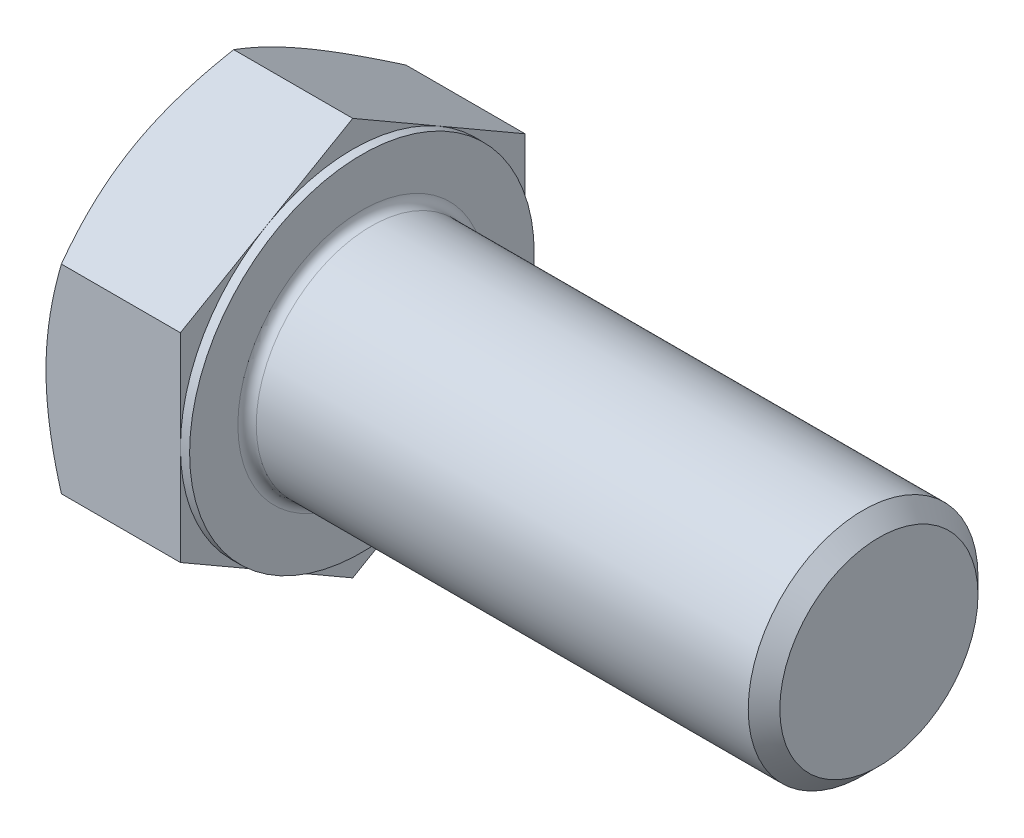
ISO-10303-21;
HEADER;
FILE_DESCRIPTION(('STEP AP214'),'2;1');
FILE_NAME('part.step','',(''),(''),'','','');
FILE_SCHEMA(('AUTOMOTIVE_DESIGN { 1 0 10303 214 1 1 1 1 }'));
ENDSEC;
DATA;
#1=APPLICATION_CONTEXT('core data for automotive mechanical design processes');
#2=APPLICATION_PROTOCOL_DEFINITION('international standard','automotive_design',2000,#1);
#3=PRODUCT_CONTEXT('',#1,'mechanical');
#4=PRODUCT('Part','Part','',(#3));
#5=PRODUCT_RELATED_PRODUCT_CATEGORY('part','',(#4));
#6=PRODUCT_DEFINITION_FORMATION('','',#4);
#7=PRODUCT_DEFINITION_CONTEXT('part definition',#1,'design');
#8=PRODUCT_DEFINITION('design','',#6,#7);
#9=PRODUCT_DEFINITION_SHAPE('','',#8);
#10=(LENGTH_UNIT() NAMED_UNIT(*) SI_UNIT(.MILLI.,.METRE.));
#11=(NAMED_UNIT(*) PLANE_ANGLE_UNIT() SI_UNIT($,.RADIAN.));
#12=(NAMED_UNIT(*) SI_UNIT($,.STERADIAN.) SOLID_ANGLE_UNIT());
#13=UNCERTAINTY_MEASURE_WITH_UNIT(LENGTH_MEASURE(1.E-05),#10,'distance_accuracy_value','');
#14=(GEOMETRIC_REPRESENTATION_CONTEXT(3) GLOBAL_UNCERTAINTY_ASSIGNED_CONTEXT((#13)) GLOBAL_UNIT_ASSIGNED_CONTEXT((#10,
#11,#12)) REPRESENTATION_CONTEXT('',''));
#15=CARTESIAN_POINT('',(0.,0.,0.));
#16=DIRECTION('',(0.,0.,1.));
#17=DIRECTION('',(1.,0.,0.));
#18=AXIS2_PLACEMENT_3D('',#15,#16,#17);
#19=CARTESIAN_POINT('',(12.5,17.3205080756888,0.));
#20=DIRECTION('',(1.,0.,0.));
#21=DIRECTION('',(0.,0.,-1.));
#22=AXIS2_PLACEMENT_3D('',#19,#20,#21);
#23=PLANE('',#22);
#24=CARTESIAN_POINT('',(12.5,0.,0.));
#25=DIRECTION('',(1.,0.,0.));
#26=DIRECTION('',(0.,0.,-1.));
#27=AXIS2_PLACEMENT_3D('',#24,#25,#26);
#28=CIRCLE('',#27,10.8);
#29=CARTESIAN_POINT('',(12.5,0.,-10.8));
#30=VERTEX_POINT('',#29);
#31=EDGE_CURVE('E40',#30,#30,#28,.F.);
#32=ORIENTED_EDGE('',*,*,#31,.T.);
#33=EDGE_LOOP('',(#32));
#34=FACE_BOUND('',#33,.T.);
#35=CARTESIAN_POINT('',(12.5,0.,0.));
#36=DIRECTION('',(1.,0.,0.));
#37=DIRECTION('',(0.,0.,-1.));
#38=AXIS2_PLACEMENT_3D('',#35,#36,#37);
#39=CIRCLE('',#38,15.);
#40=CARTESIAN_POINT('',(12.5,0.,-15.));
#41=VERTEX_POINT('',#40);
#42=EDGE_CURVE('E291',#41,#41,#39,.T.);
#43=ORIENTED_EDGE('',*,*,#42,.T.);
#44=EDGE_LOOP('',(#43));
#45=FACE_BOUND('',#44,.T.);
#46=ADVANCED_FACE('F32',(#34,#45),#23,.T.);
#47=CARTESIAN_POINT('',(0.,0.,0.));
#48=DIRECTION('',(-1.,0.,0.));
#49=DIRECTION('',(0.,0.,1.));
#50=AXIS2_PLACEMENT_3D('',#47,#48,#49);
#51=CYLINDRICAL_SURFACE('',#50,10.);
#52=CARTESIAN_POINT('',(13.3,0.,0.));
#53=DIRECTION('',(1.,0.,0.));
#54=DIRECTION('',(0.,0.,-1.));
#55=AXIS2_PLACEMENT_3D('',#52,#53,#54);
#56=CIRCLE('',#55,10.);
#57=CARTESIAN_POINT('',(13.3,0.,-10.));
#58=VERTEX_POINT('',#57);
#59=EDGE_CURVE('E11',#58,#58,#56,.T.);
#60=ORIENTED_EDGE('',*,*,#59,.T.);
#61=EDGE_LOOP('',(#60));
#62=FACE_BOUND('',#61,.T.);
#63=CARTESIAN_POINT('',(56.126,0.,0.));
#64=DIRECTION('',(-1.,0.,0.));
#65=DIRECTION('',(0.,0.,1.));
#66=AXIS2_PLACEMENT_3D('',#63,#64,#65);
#67=CIRCLE('',#66,10.);
#68=CARTESIAN_POINT('',(56.126,0.,10.));
#69=VERTEX_POINT('',#68);
#70=EDGE_CURVE('E270',#69,#69,#67,.T.);
#71=ORIENTED_EDGE('',*,*,#70,.T.);
#72=EDGE_LOOP('',(#71));
#73=FACE_BOUND('',#72,.T.);
#74=ADVANCED_FACE('F244',(#62,#73),#51,.T.);
#75=CARTESIAN_POINT('',(57.5,0.,0.));
#76=DIRECTION('',(-1.,0.,0.));
#77=DIRECTION('',(0.,0.,1.));
#78=AXIS2_PLACEMENT_3D('',#75,#76,#77);
#79=CONICAL_SURFACE('',#78,8.626,0.785398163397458);
#80=ORIENTED_EDGE('',*,*,#70,.F.);
#81=EDGE_LOOP('',(#80));
#82=FACE_BOUND('',#81,.T.);
#83=CARTESIAN_POINT('',(57.5,0.,0.));
#84=DIRECTION('',(-1.,0.,0.));
#85=DIRECTION('',(0.,0.,1.));
#86=AXIS2_PLACEMENT_3D('',#83,#84,#85);
#87=CIRCLE('',#86,8.626);
#88=CARTESIAN_POINT('',(57.5,0.,8.626));
#89=VERTEX_POINT('',#88);
#90=EDGE_CURVE('E268',#89,#89,#87,.T.);
#91=ORIENTED_EDGE('',*,*,#90,.T.);
#92=EDGE_LOOP('',(#91));
#93=FACE_BOUND('',#92,.T.);
#94=ADVANCED_FACE('F249',(#82,#93),#79,.T.);
#95=CARTESIAN_POINT('',(57.5,0.,0.));
#96=DIRECTION('',(-1.,0.,0.));
#97=DIRECTION('',(0.,0.,1.));
#98=AXIS2_PLACEMENT_3D('',#95,#96,#97);
#99=PLANE('',#98);
#100=ORIENTED_EDGE('',*,*,#90,.F.);
#101=EDGE_LOOP('',(#100));
#102=FACE_BOUND('',#101,.T.);
#103=ADVANCED_FACE('F256',(#102),#99,.F.);
#104=CARTESIAN_POINT('',(11.7,15.,0.));
#105=DIRECTION('',(1.,0.,0.));
#106=DIRECTION('',(0.,0.,-1.));
#107=AXIS2_PLACEMENT_3D('',#104,#105,#106);
#108=PLANE('',#107);
#109=DIRECTION('',(0.,0.500000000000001,0.866025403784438));
#110=VECTOR('',#109,1.);
#111=CARTESIAN_POINT('',(11.7,8.66025403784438,-15.));
#112=LINE('',#111,#110);
#113=CARTESIAN_POINT('',(11.7,8.66025403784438,-15.));
#114=VERTEX_POINT('',#113);
#115=CARTESIAN_POINT('',(11.7,12.9903810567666,-7.50000000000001));
#116=VERTEX_POINT('',#115);
#117=EDGE_CURVE('E164',#114,#116,#112,.T.);
#118=ORIENTED_EDGE('',*,*,#117,.T.);
#119=CARTESIAN_POINT('',(11.7,0.,0.));
#120=DIRECTION('',(-1.,0.,0.));
#121=DIRECTION('',(0.,0.,1.));
#122=AXIS2_PLACEMENT_3D('',#119,#120,#121);
#123=CIRCLE('',#122,15.);
#124=CARTESIAN_POINT('',(11.7,0.,-15.));
#125=VERTEX_POINT('',#124);
#126=EDGE_CURVE('E47',#116,#125,#123,.T.);
#127=ORIENTED_EDGE('',*,*,#126,.T.);
#128=DIRECTION('',(0.,1.,0.));
#129=VECTOR('',#128,1.);
#130=CARTESIAN_POINT('',(11.7,8.66025403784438,-15.));
#131=LINE('',#130,#129);
#132=EDGE_CURVE('E294',#125,#114,#131,.T.);
#133=ORIENTED_EDGE('',*,*,#132,.T.);
#134=EDGE_LOOP('',(#118,#127,#133));
#135=FACE_BOUND('',#134,.T.);
#136=ADVANCED_FACE('F259',(#135),#108,.T.);
#137=CARTESIAN_POINT('',(11.7,17.3205080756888,0.));
#138=VERTEX_POINT('',#137);
#139=EDGE_CURVE('E162',#116,#138,#112,.T.);
#140=ORIENTED_EDGE('',*,*,#139,.T.);
#141=DIRECTION('',(0.,-0.500000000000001,0.866025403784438));
#142=VECTOR('',#141,1.);
#143=CARTESIAN_POINT('',(11.7,17.3205080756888,0.));
#144=LINE('',#143,#142);
#145=CARTESIAN_POINT('',(11.7,12.9903810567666,7.50000000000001));
#146=VERTEX_POINT('',#145);
#147=EDGE_CURVE('E161',#138,#146,#144,.T.);
#148=ORIENTED_EDGE('',*,*,#147,.T.);
#149=EDGE_CURVE('E150',#146,#116,#123,.T.);
#150=ORIENTED_EDGE('',*,*,#149,.T.);
#151=EDGE_LOOP('',(#140,#148,#150));
#152=FACE_BOUND('',#151,.T.);
#153=ADVANCED_FACE('F264',(#152),#108,.T.);
#154=CARTESIAN_POINT('',(11.7,8.66025403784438,15.));
#155=VERTEX_POINT('',#154);
#156=EDGE_CURVE('E129',#146,#155,#144,.T.);
#157=ORIENTED_EDGE('',*,*,#156,.T.);
#158=DIRECTION('',(0.,-1.,0.));
#159=VECTOR('',#158,1.);
#160=CARTESIAN_POINT('',(11.7,8.66025403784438,15.));
#161=LINE('',#160,#159);
#162=CARTESIAN_POINT('',(11.7,0.,15.));
#163=VERTEX_POINT('',#162);
#164=EDGE_CURVE('E123',#155,#163,#161,.T.);
#165=ORIENTED_EDGE('',*,*,#164,.T.);
#166=EDGE_CURVE('E127',#163,#146,#123,.T.);
#167=ORIENTED_EDGE('',*,*,#166,.T.);
#168=EDGE_LOOP('',(#157,#165,#167));
#169=FACE_BOUND('',#168,.T.);
#170=ADVANCED_FACE('F125',(#169),#108,.T.);
#171=CARTESIAN_POINT('',(11.7,-8.66025403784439,15.));
#172=VERTEX_POINT('',#171);
#173=EDGE_CURVE('E133',#163,#172,#161,.T.);
#174=ORIENTED_EDGE('',*,*,#173,.T.);
#175=DIRECTION('',(0.,-0.500000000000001,-0.866025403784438));
#176=VECTOR('',#175,1.);
#177=CARTESIAN_POINT('',(11.7,-17.3205080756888,0.));
#178=LINE('',#177,#176);
#179=CARTESIAN_POINT('',(11.7,-12.9903810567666,7.50000000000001));
#180=VERTEX_POINT('',#179);
#181=EDGE_CURVE('E140',#172,#180,#178,.T.);
#182=ORIENTED_EDGE('',*,*,#181,.T.);
#183=EDGE_CURVE('E137',#180,#163,#123,.T.);
#184=ORIENTED_EDGE('',*,*,#183,.T.);
#185=EDGE_LOOP('',(#174,#182,#184));
#186=FACE_BOUND('',#185,.T.);
#187=ADVANCED_FACE('F138',(#186),#108,.T.);
#188=CARTESIAN_POINT('',(11.7,-17.3205080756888,0.));
#189=VERTEX_POINT('',#188);
#190=EDGE_CURVE('E156',#180,#189,#178,.T.);
#191=ORIENTED_EDGE('',*,*,#190,.T.);
#192=DIRECTION('',(0.,0.5,-0.866025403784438));
#193=VECTOR('',#192,1.);
#194=CARTESIAN_POINT('',(11.7,-8.6602540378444,-15.));
#195=LINE('',#194,#193);
#196=CARTESIAN_POINT('',(11.7,-12.9903810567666,-7.50000000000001));
#197=VERTEX_POINT('',#196);
#198=EDGE_CURVE('E332',#189,#197,#195,.T.);
#199=ORIENTED_EDGE('',*,*,#198,.T.);
#200=EDGE_CURVE('E144',#197,#180,#123,.T.);
#201=ORIENTED_EDGE('',*,*,#200,.T.);
#202=EDGE_LOOP('',(#191,#199,#201));
#203=FACE_BOUND('',#202,.T.);
#204=ADVANCED_FACE('F333',(#203),#108,.T.);
#205=CARTESIAN_POINT('',(11.7,-8.6602540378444,-15.));
#206=VERTEX_POINT('',#205);
#207=EDGE_CURVE('E151',#197,#206,#195,.T.);
#208=ORIENTED_EDGE('',*,*,#207,.T.);
#209=EDGE_CURVE('E295',#206,#125,#131,.T.);
#210=ORIENTED_EDGE('',*,*,#209,.T.);
#211=EDGE_CURVE('E302',#125,#197,#123,.T.);
#212=ORIENTED_EDGE('',*,*,#211,.T.);
#213=EDGE_LOOP('',(#208,#210,#212));
#214=FACE_BOUND('',#213,.T.);
#215=ADVANCED_FACE('F265',(#214),#108,.T.);
#216=CARTESIAN_POINT('',(0.,0.,0.));
#217=DIRECTION('',(-1.,0.,0.));
#218=DIRECTION('',(0.,0.,1.));
#219=AXIS2_PLACEMENT_3D('',#216,#217,#218);
#220=CYLINDRICAL_SURFACE('',#219,15.);
#221=ORIENTED_EDGE('',*,*,#126,.F.);
#222=ORIENTED_EDGE('',*,*,#149,.F.);
#223=ORIENTED_EDGE('',*,*,#166,.F.);
#224=ORIENTED_EDGE('',*,*,#183,.F.);
#225=ORIENTED_EDGE('',*,*,#200,.F.);
#226=ORIENTED_EDGE('',*,*,#211,.F.);
#227=EDGE_LOOP('',(#221,#222,#223,#224,#225,#226));
#228=FACE_BOUND('',#227,.T.);
#229=ORIENTED_EDGE('',*,*,#42,.F.);
#230=EDGE_LOOP('',(#229));
#231=FACE_BOUND('',#230,.T.);
#232=ADVANCED_FACE('F147',(#228,#231),#220,.T.);
#233=CARTESIAN_POINT('',(0.,17.3205080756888,0.));
#234=DIRECTION('',(1.,0.,0.));
#235=DIRECTION('',(0.,0.,-1.));
#236=AXIS2_PLACEMENT_3D('',#233,#234,#235);
#237=PLANE('',#236);
#238=CARTESIAN_POINT('',(0.,0.,0.));
#239=DIRECTION('',(1.,0.,0.));
#240=DIRECTION('',(0.,0.,-1.));
#241=AXIS2_PLACEMENT_3D('',#238,#239,#240);
#242=CIRCLE('',#241,15.);
#243=CARTESIAN_POINT('',(0.,0.,-15.));
#244=VERTEX_POINT('',#243);
#245=CARTESIAN_POINT('',(0.,12.9903810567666,-7.50000000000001));
#246=VERTEX_POINT('',#245);
#247=EDGE_CURVE('E290',#244,#246,#242,.T.);
#248=ORIENTED_EDGE('',*,*,#247,.F.);
#249=CARTESIAN_POINT('',(0.,-12.9903810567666,-7.50000000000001));
#250=VERTEX_POINT('',#249);
#251=EDGE_CURVE('E286',#250,#244,#242,.T.);
#252=ORIENTED_EDGE('',*,*,#251,.F.);
#253=CARTESIAN_POINT('',(0.,-12.9903810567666,7.50000000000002));
#254=VERTEX_POINT('',#253);
#255=EDGE_CURVE('E289',#254,#250,#242,.T.);
#256=ORIENTED_EDGE('',*,*,#255,.F.);
#257=CARTESIAN_POINT('',(0.,0.,15.));
#258=VERTEX_POINT('',#257);
#259=EDGE_CURVE('E325',#258,#254,#242,.T.);
#260=ORIENTED_EDGE('',*,*,#259,.F.);
#261=CARTESIAN_POINT('',(0.,0.,0.));
#262=DIRECTION('',(-1.,0.,0.));
#263=DIRECTION('',(0.,0.,1.));
#264=AXIS2_PLACEMENT_3D('',#261,#262,#263);
#265=CIRCLE('',#264,15.);
#266=CARTESIAN_POINT('',(0.,12.9903810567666,7.50000000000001));
#267=VERTEX_POINT('',#266);
#268=EDGE_CURVE('E165',#258,#267,#265,.T.);
#269=ORIENTED_EDGE('',*,*,#268,.T.);
#270=EDGE_CURVE('E348',#246,#267,#242,.T.);
#271=ORIENTED_EDGE('',*,*,#270,.F.);
#272=EDGE_LOOP('',(#248,#252,#256,#260,#269,#271));
#273=FACE_BOUND('',#272,.T.);
#274=ADVANCED_FACE('F194',(#273),#237,.F.);
#275=CARTESIAN_POINT('',(0.,0.,0.));
#276=DIRECTION('',(1.,0.,0.));
#277=DIRECTION('',(0.,0.,-1.));
#278=AXIS2_PLACEMENT_3D('',#275,#276,#277);
#279=CONICAL_SURFACE('',#278,15.,1.0471975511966);
#280=CARTESIAN_POINT('',(1.33981262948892,8.66013856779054,15.0002));
#281=CARTESIAN_POINT('',(1.22992178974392,8.85048754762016,14.6705058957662));
#282=CARTESIAN_POINT('',(1.12501758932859,9.04157899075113,14.3395258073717));
#283=CARTESIAN_POINT('',(0.926568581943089,9.42529420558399,13.674911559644));
#284=CARTESIAN_POINT('',(0.83302751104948,9.61791845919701,13.3412765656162));
#285=CARTESIAN_POINT('',(0.658562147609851,10.0050715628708,12.6707077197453));
#286=CARTESIAN_POINT('',(0.57766770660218,10.199603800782,12.333767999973));
#287=CARTESIAN_POINT('',(0.430232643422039,10.5900200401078,11.6575472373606));
#288=CARTESIAN_POINT('',(0.363691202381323,10.7859039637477,11.3182663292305));
#289=CARTESIAN_POINT('',(0.247792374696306,11.1740042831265,10.6460568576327));
#290=CARTESIAN_POINT('',(0.198051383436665,11.3661918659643,10.3131781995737));
#291=CARTESIAN_POINT('',(0.114646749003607,11.7514476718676,9.64589556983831));
#292=CARTESIAN_POINT('',(0.0809834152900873,11.9445159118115,9.31149156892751));
#293=CARTESIAN_POINT('',(0.0305840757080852,12.3309767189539,8.64212181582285));
#294=CARTESIAN_POINT('',(0.0138279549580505,12.5243686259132,8.30715720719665));
#295=CARTESIAN_POINT('',(-0.00239660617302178,12.9113309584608,7.636918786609));
#296=CARTESIAN_POINT('',(-0.00186558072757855,13.1049013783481,7.30164498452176));
#297=CARTESIAN_POINT('',(0.0152766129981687,13.4667798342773,6.67485311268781));
#298=CARTESIAN_POINT('',(0.0297968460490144,13.6351136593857,6.38329037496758));
#299=CARTESIAN_POINT('',(0.0716371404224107,13.9713941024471,5.80083556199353));
#300=CARTESIAN_POINT('',(0.0989581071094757,14.1393406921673,5.50994353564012));
#301=CARTESIAN_POINT('',(0.165923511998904,14.4747554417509,4.92898814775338));
#302=CARTESIAN_POINT('',(0.205578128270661,14.6422230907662,4.63892567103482));
#303=CARTESIAN_POINT('',(0.296515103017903,14.9763732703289,4.06016058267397));
#304=CARTESIAN_POINT('',(0.347798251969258,15.1430557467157,3.77145806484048));
#305=CARTESIAN_POINT('',(0.520386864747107,15.6490296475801,2.8950855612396));
#306=CARTESIAN_POINT('',(0.658901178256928,15.9868558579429,2.30995340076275));
#307=CARTESIAN_POINT('',(0.973271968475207,16.6574708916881,1.14841408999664));
#308=CARTESIAN_POINT('',(1.14905461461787,16.9902683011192,0.571992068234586));
#309=CARTESIAN_POINT('',(1.33981262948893,17.3206235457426,-0.000199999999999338));
#310=B_SPLINE_CURVE_WITH_KNOTS('',3,(#280,#281,#282,#283,#284,#285,#286,#287,#288,#289,#290,
#291,#292,#293,#294,#295,#296,#297,#298,#299,#300,#301,#302,#303,#304,#305,#306,#307,#308,#309),
.UNSPECIFIED.,.F.,.F.,(4,2,2,2,2,2,2,2,2,2,2,2,2,2,4),(0.,1.18875411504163,2.37789802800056,
3.56980778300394,4.76164951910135,5.92407379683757,7.0865204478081,8.24758247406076,
9.40860862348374,10.4193068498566,11.4300765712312,12.4416826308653,13.4533574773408,
15.5211962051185,17.5849760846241),.UNSPECIFIED.);
#311=CARTESIAN_POINT('',(1.3397459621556,17.3205080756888,0.));
#312=VERTEX_POINT('',#311);
#313=EDGE_CURVE('E213',#267,#312,#310,.T.);
#314=ORIENTED_EDGE('',*,*,#313,.T.);
#315=CARTESIAN_POINT('',(1.33981262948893,17.3206235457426,0.00020000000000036));
#316=CARTESIAN_POINT('',(1.22992178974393,17.130274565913,-0.329494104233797));
#317=CARTESIAN_POINT('',(1.1250175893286,16.939183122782,-0.660474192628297));
#318=CARTESIAN_POINT('',(0.926568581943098,16.5554679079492,-1.32508844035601));
#319=CARTESIAN_POINT('',(0.833027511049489,16.3628436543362,-1.6587234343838));
#320=CARTESIAN_POINT('',(0.658562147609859,15.9756905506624,-2.32929228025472));
#321=CARTESIAN_POINT('',(0.577667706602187,15.7811583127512,-2.66623200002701));
#322=CARTESIAN_POINT('',(0.430232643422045,15.3907420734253,-3.34245276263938));
#323=CARTESIAN_POINT('',(0.363691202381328,15.1948581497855,-3.68173367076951));
#324=CARTESIAN_POINT('',(0.24779237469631,14.8067578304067,-4.35394314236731));
#325=CARTESIAN_POINT('',(0.198051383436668,14.6145702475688,-4.68682180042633));
#326=CARTESIAN_POINT('',(0.11464674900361,14.2293144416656,-5.35410443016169));
#327=CARTESIAN_POINT('',(0.0809834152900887,14.0362462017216,-5.68850843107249));
#328=CARTESIAN_POINT('',(0.0305840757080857,13.6497853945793,-6.35787818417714));
#329=CARTESIAN_POINT('',(0.013827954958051,13.4563934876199,-6.69284279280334));
#330=CARTESIAN_POINT('',(-0.00239660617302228,13.0694311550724,-7.363081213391));
#331=CARTESIAN_POINT('',(-0.00186558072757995,12.8758607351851,-7.69835501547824));
#332=CARTESIAN_POINT('',(0.0152766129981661,12.5139822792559,-8.3251468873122));
#333=CARTESIAN_POINT('',(0.0297968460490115,12.3456484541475,-8.61670962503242));
#334=CARTESIAN_POINT('',(0.0716371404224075,12.0093680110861,-9.19916443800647));
#335=CARTESIAN_POINT('',(0.0989581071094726,11.8414214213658,-9.49005646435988));
#336=CARTESIAN_POINT('',(0.1659235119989,11.5060066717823,-10.0710118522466));
#337=CARTESIAN_POINT('',(0.205578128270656,11.338539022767,-10.3610743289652));
#338=CARTESIAN_POINT('',(0.296515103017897,11.0043888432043,-10.939839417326));
#339=CARTESIAN_POINT('',(0.347798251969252,10.8377063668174,-11.2285419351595));
#340=CARTESIAN_POINT('',(0.5203868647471,10.3317324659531,-12.1049144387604));
#341=CARTESIAN_POINT('',(0.65890117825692,9.99390625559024,-12.6900465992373));
#342=CARTESIAN_POINT('',(0.973271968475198,9.32329122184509,-13.8515859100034));
#343=CARTESIAN_POINT('',(1.14905461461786,8.99049381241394,-14.4280079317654));
#344=CARTESIAN_POINT('',(1.33981262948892,8.66013856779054,-15.0002));
#345=B_SPLINE_CURVE_WITH_KNOTS('',3,(#315,#316,#317,#318,#319,#320,#321,#322,#323,#324,#325,
#326,#327,#328,#329,#330,#331,#332,#333,#334,#335,#336,#337,#338,#339,#340,#341,#342,#343,#344),
.UNSPECIFIED.,.F.,.F.,(4,2,2,2,2,2,2,2,2,2,2,2,2,2,4),(0.,1.18875411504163,2.37789802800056,
3.56980778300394,4.76164951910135,5.92407379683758,7.08652044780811,8.24758247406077,
9.40860862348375,10.4193068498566,11.4300765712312,12.4416826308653,13.4533574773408,
15.5211962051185,17.5849760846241),.UNSPECIFIED.);
#346=EDGE_CURVE('E55',#312,#246,#345,.T.);
#347=ORIENTED_EDGE('',*,*,#346,.T.);
#348=ORIENTED_EDGE('',*,*,#270,.T.);
#349=EDGE_LOOP('',(#314,#347,#348));
#350=FACE_BOUND('',#349,.T.);
#351=ADVANCED_FACE('F349',(#350),#279,.T.);
#352=CARTESIAN_POINT('',(7.37312634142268,-23.3710902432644,15.));
#353=CARTESIAN_POINT('',(7.21375262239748,-23.0430760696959,15.));
#354=CARTESIAN_POINT('',(7.05516544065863,-22.7146799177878,15.));
#355=CARTESIAN_POINT('',(6.73974206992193,-22.0570439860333,15.));
#356=CARTESIAN_POINT('',(6.58290589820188,-21.7278041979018,15.));
#357=CARTESIAN_POINT('',(6.11525014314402,-20.7386136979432,15.));
#358=CARTESIAN_POINT('',(5.80732977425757,-20.0772872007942,15.));
#359=CARTESIAN_POINT('',(5.19942693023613,-18.7466975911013,15.));
#360=CARTESIAN_POINT('',(4.89949586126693,-18.0774109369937,15.));
#361=CARTESIAN_POINT('',(4.31175828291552,-16.7335531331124,15.));
#362=CARTESIAN_POINT('',(4.02395120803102,-16.0589822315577,15.));
#363=CARTESIAN_POINT('',(3.45448123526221,-14.6812618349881,15.));
#364=CARTESIAN_POINT('',(3.17332879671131,-13.9779002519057,15.));
#365=CARTESIAN_POINT('',(2.63203971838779,-12.5629833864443,15.));
#366=CARTESIAN_POINT('',(2.37190542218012,-11.8514272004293,15.));
#367=CARTESIAN_POINT('',(1.87940642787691,-10.4203092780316,15.));
#368=CARTESIAN_POINT('',(1.64698643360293,-9.70076672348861,15.));
#369=CARTESIAN_POINT('',(1.21728875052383,-8.25129237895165,15.));
#370=CARTESIAN_POINT('',(1.02000010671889,-7.52136390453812,15.));
#371=CARTESIAN_POINT('',(0.758044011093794,-6.4205785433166,15.));
#372=CARTESIAN_POINT('',(0.676568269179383,-6.05369801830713,15.));
#373=CARTESIAN_POINT('',(0.525901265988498,-5.31741005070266,15.));
#374=CARTESIAN_POINT('',(0.456709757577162,-4.9480026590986,15.));
#375=CARTESIAN_POINT('',(0.331825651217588,-4.20690684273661,15.));
#376=CARTESIAN_POINT('',(0.276132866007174,-3.83521844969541,15.));
#377=CARTESIAN_POINT('',(0.179353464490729,-3.08994807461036,15.));
#378=CARTESIAN_POINT('',(0.138266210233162,-2.71636617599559,15.));
#379=CARTESIAN_POINT('',(0.072034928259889,-1.97275308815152,15.));
#380=CARTESIAN_POINT('',(0.0466876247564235,-1.60274011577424,15.));
#381=CARTESIAN_POINT('',(0.0116690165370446,-0.861974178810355,15.));
#382=CARTESIAN_POINT('',(0.0019974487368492,-0.491221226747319,15.));
#383=CARTESIAN_POINT('',(-0.00143922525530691,0.250361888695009,15.));
#384=CARTESIAN_POINT('',(0.00479570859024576,0.621192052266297,15.));
#385=CARTESIAN_POINT('',(0.0330186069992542,1.36225664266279,15.));
#386=CARTESIAN_POINT('',(0.0550072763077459,1.73249104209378,15.));
#387=CARTESIAN_POINT('',(0.126051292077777,2.61901692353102,15.));
#388=CARTESIAN_POINT('',(0.182399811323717,3.13473445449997,15.));
#389=CARTESIAN_POINT('',(0.322620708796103,4.16241630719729,15.));
#390=CARTESIAN_POINT('',(0.406496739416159,4.67438012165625,15.));
#391=CARTESIAN_POINT('',(0.598789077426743,5.69404144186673,15.));
#392=CARTESIAN_POINT('',(0.70722421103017,6.20173536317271,15.));
#393=CARTESIAN_POINT('',(0.94531956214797,7.21206683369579,15.));
#394=CARTESIAN_POINT('',(1.07497948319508,7.7147044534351,15.));
#395=CARTESIAN_POINT('',(1.35544197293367,8.72603000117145,15.));
#396=CARTESIAN_POINT('',(1.50664978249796,9.23460476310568,15.));
#397=CARTESIAN_POINT('',(1.8249043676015,10.246745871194,15.));
#398=CARTESIAN_POINT('',(1.99195124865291,10.7503121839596,15.));
#399=CARTESIAN_POINT('',(2.33921280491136,11.7526813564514,15.));
#400=CARTESIAN_POINT('',(2.51942324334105,12.2514856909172,15.));
#401=CARTESIAN_POINT('',(2.89087066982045,13.2449469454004,15.));
#402=CARTESIAN_POINT('',(3.08210752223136,13.7396039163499,15.));
#403=CARTESIAN_POINT('',(3.54947439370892,14.9157121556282,15.));
#404=CARTESIAN_POINT('',(3.82985054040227,15.5954736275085,15.));
#405=CARTESIAN_POINT('',(4.40448813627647,16.9491200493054,15.));
#406=CARTESIAN_POINT('',(4.69875048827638,17.6230046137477,15.));
#407=CARTESIAN_POINT('',(5.29835231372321,18.9660045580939,15.));
#408=CARTESIAN_POINT('',(5.60369438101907,19.6351187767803,15.));
#409=CARTESIAN_POINT('',(6.22319663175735,20.9692236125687,15.));
#410=CARTESIAN_POINT('',(6.53735661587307,21.6342143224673,15.));
#411=CARTESIAN_POINT('',(7.1731911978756,22.9615174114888,15.));
#412=CARTESIAN_POINT('',(7.49487393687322,23.6238258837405,15.));
#413=CARTESIAN_POINT('',(8.14411318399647,24.9455571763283,15.));
#414=CARTESIAN_POINT('',(8.47166971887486,25.6049799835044,15.));
#415=CARTESIAN_POINT('',(9.13159579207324,26.9212980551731,15.));
#416=CARTESIAN_POINT('',(9.46396466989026,27.5781936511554,15.));
#417=CARTESIAN_POINT('',(10.1327647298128,28.8899147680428,15.));
#418=CARTESIAN_POINT('',(10.4691959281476,29.5447402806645,15.));
#419=CARTESIAN_POINT('',(11.4259204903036,31.395022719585,15.));
#420=CARTESIAN_POINT('',(12.0502117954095,32.5884123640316,15.));
#421=CARTESIAN_POINT('',(13.3073006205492,34.9707491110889,15.));
#422=CARTESIAN_POINT('',(13.9400984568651,36.1596960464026,15.));
#423=CARTESIAN_POINT('',(15.2105565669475,38.5310463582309,15.));
#424=CARTESIAN_POINT('',(15.8482001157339,39.7134587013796,15.));
#425=CARTESIAN_POINT('',(16.8084387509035,41.4849860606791,15.));
#426=CARTESIAN_POINT('',(17.1291381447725,42.0751301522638,15.));
#427=CARTESIAN_POINT('',(17.7716684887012,43.2548008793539,15.));
#428=CARTESIAN_POINT('',(18.0934994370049,43.8443275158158,15.));
#429=CARTESIAN_POINT('',(18.4158306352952,44.4335805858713,15.));
#430=B_SPLINE_CURVE_WITH_KNOTS('',3,(#352,#353,#354,#355,#356,#357,#358,#359,#360,#361,#362,
#363,#364,#365,#366,#367,#368,#369,#370,#371,#372,#373,#374,#375,#376,#377,#378,#379,#380,#381,
#382,#383,#384,#385,#386,#387,#388,#389,#390,#391,#392,#393,#394,#395,#396,#397,#398,#399,#400,
#401,#402,#403,#404,#405,#406,#407,#408,#409,#410,#411,#412,#413,#414,#415,#416,#417,#418,#419,
#420,#421,#422,#423,#424,#425,#426,#427,#428,#429),.UNSPECIFIED.,.F.,.F.,(4,2,2,2,2,2,2,2,2,2,2,
2,2,2,2,2,2,2,2,2,2,2,2,2,2,2,2,2,2,2,2,2,2,2,2,2,2,2,4),(0.,1.09404536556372,2.18810151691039,
4.37653199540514,6.57669491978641,8.7767551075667,11.0489153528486,13.3213285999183,
15.5891291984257,17.8562213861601,18.9835047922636,20.1107655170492,21.2380106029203,
22.3652064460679,23.4775244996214,24.5898238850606,25.7021260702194,26.8144780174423,
28.369980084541,29.9256886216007,31.4825937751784,33.0394771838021,34.6309007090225,
36.2223348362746,37.8132589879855,39.4041635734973,41.6098943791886,43.8157687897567,
46.0221629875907,48.2285073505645,50.4373613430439,52.6462253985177,54.854789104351,
57.0633616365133,61.1037632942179,65.1443155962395,69.1744593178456,71.1894182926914,
73.2043741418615),.UNSPECIFIED.);
#431=CARTESIAN_POINT('',(1.33974596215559,8.66025403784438,15.));
#432=VERTEX_POINT('',#431);
#433=EDGE_CURVE('E225',#258,#432,#430,.T.);
#434=ORIENTED_EDGE('',*,*,#433,.T.);
#435=EDGE_CURVE('E224',#432,#267,#310,.T.);
#436=ORIENTED_EDGE('',*,*,#435,.T.);
#437=ORIENTED_EDGE('',*,*,#268,.F.);
#438=EDGE_LOOP('',(#434,#436,#437));
#439=FACE_BOUND('',#438,.T.);
#440=ADVANCED_FACE('F319',(#439),#279,.T.);
#441=CARTESIAN_POINT('',(1.3397459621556,-8.66025403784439,15.));
#442=VERTEX_POINT('',#441);
#443=EDGE_CURVE('E271',#442,#258,#430,.T.);
#444=ORIENTED_EDGE('',*,*,#443,.T.);
#445=ORIENTED_EDGE('',*,*,#259,.T.);
#446=CARTESIAN_POINT('',(1.33981262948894,-17.3206235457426,-0.000200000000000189));
#447=CARTESIAN_POINT('',(1.22992178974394,-17.130274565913,0.3294941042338));
#448=CARTESIAN_POINT('',(1.12501758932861,-16.9391831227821,0.6604741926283));
#449=CARTESIAN_POINT('',(0.926568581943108,-16.5554679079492,1.32508844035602));
#450=CARTESIAN_POINT('',(0.833027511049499,-16.3628436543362,1.6587234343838));
#451=CARTESIAN_POINT('',(0.658562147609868,-15.9756905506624,2.32929228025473));
#452=CARTESIAN_POINT('',(0.577667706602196,-15.7811583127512,2.66623200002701));
#453=CARTESIAN_POINT('',(0.430232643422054,-15.3907420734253,3.34245276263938));
#454=CARTESIAN_POINT('',(0.363691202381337,-15.1948581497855,3.68173367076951));
#455=CARTESIAN_POINT('',(0.247792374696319,-14.8067578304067,4.35394314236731));
#456=CARTESIAN_POINT('',(0.198051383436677,-14.6145702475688,4.68682180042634));
#457=CARTESIAN_POINT('',(0.114646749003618,-14.2293144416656,5.35410443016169));
#458=CARTESIAN_POINT('',(0.0809834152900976,-14.0362462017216,5.68850843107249));
#459=CARTESIAN_POINT('',(0.0305840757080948,-13.6497853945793,6.35787818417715));
#460=CARTESIAN_POINT('',(0.0138279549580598,-13.4563934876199,6.69284279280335));
#461=CARTESIAN_POINT('',(-0.00239660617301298,-13.0694311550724,7.363081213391));
#462=CARTESIAN_POINT('',(-0.00186558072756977,-12.8758607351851,7.69835501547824));
#463=CARTESIAN_POINT('',(0.0152766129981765,-12.5139822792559,8.3251468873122));
#464=CARTESIAN_POINT('',(0.0297968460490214,-12.3456484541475,8.61670962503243));
#465=CARTESIAN_POINT('',(0.0716371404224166,-12.0093680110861,9.19916443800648));
#466=CARTESIAN_POINT('',(0.0989581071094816,-11.8414214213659,9.49005646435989));
#467=CARTESIAN_POINT('',(0.165923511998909,-11.5060066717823,10.0710118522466));
#468=CARTESIAN_POINT('',(0.205578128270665,-11.338539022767,10.3610743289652));
#469=CARTESIAN_POINT('',(0.296515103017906,-11.0043888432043,10.939839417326));
#470=CARTESIAN_POINT('',(0.34779825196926,-10.8377063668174,11.2285419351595));
#471=CARTESIAN_POINT('',(0.520386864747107,-10.3317324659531,12.1049144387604));
#472=CARTESIAN_POINT('',(0.658901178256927,-9.99390625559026,12.6900465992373));
#473=CARTESIAN_POINT('',(0.973271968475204,-9.32329122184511,13.8515859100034));
#474=CARTESIAN_POINT('',(1.14905461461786,-8.99049381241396,14.4280079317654));
#475=CARTESIAN_POINT('',(1.33981262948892,-8.66013856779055,15.0002));
#476=B_SPLINE_CURVE_WITH_KNOTS('',3,(#446,#447,#448,#449,#450,#451,#452,#453,#454,#455,#456,
#457,#458,#459,#460,#461,#462,#463,#464,#465,#466,#467,#468,#469,#470,#471,#472,#473,#474,#475),
.UNSPECIFIED.,.F.,.F.,(4,2,2,2,2,2,2,2,2,2,2,2,2,2,4),(0.,1.18875411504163,2.37789802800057,
3.56980778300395,4.76164951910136,5.92407379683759,7.08652044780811,8.24758247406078,
9.40860862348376,10.4193068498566,11.4300765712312,12.4416826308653,13.4533574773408,
15.5211962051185,17.5849760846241),.UNSPECIFIED.);
#477=EDGE_CURVE('E215',#254,#442,#476,.T.);
#478=ORIENTED_EDGE('',*,*,#477,.T.);
#479=EDGE_LOOP('',(#444,#445,#478));
#480=FACE_BOUND('',#479,.T.);
#481=ADVANCED_FACE('F183',(#480),#279,.T.);
#482=CARTESIAN_POINT('',(1.33974596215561,-17.3205080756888,0.));
#483=VERTEX_POINT('',#482);
#484=EDGE_CURVE('E208',#483,#254,#476,.T.);
#485=ORIENTED_EDGE('',*,*,#484,.T.);
#486=ORIENTED_EDGE('',*,*,#255,.T.);
#487=CARTESIAN_POINT('',(1.33981262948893,-8.66013856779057,-15.0002));
#488=CARTESIAN_POINT('',(1.22992178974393,-8.85048754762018,-14.6705058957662));
#489=CARTESIAN_POINT('',(1.12501758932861,-9.04157899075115,-14.3395258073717));
#490=CARTESIAN_POINT('',(0.926568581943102,-9.42529420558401,-13.674911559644));
#491=CARTESIAN_POINT('',(0.833027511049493,-9.61791845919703,-13.3412765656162));
#492=CARTESIAN_POINT('',(0.658562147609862,-10.0050715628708,-12.6707077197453));
#493=CARTESIAN_POINT('',(0.577667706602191,-10.199603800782,-12.333767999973));
#494=CARTESIAN_POINT('',(0.430232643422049,-10.5900200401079,-11.6575472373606));
#495=CARTESIAN_POINT('',(0.363691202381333,-10.7859039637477,-11.3182663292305));
#496=CARTESIAN_POINT('',(0.247792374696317,-11.1740042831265,-10.6460568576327));
#497=CARTESIAN_POINT('',(0.198051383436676,-11.3661918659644,-10.3131781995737));
#498=CARTESIAN_POINT('',(0.114646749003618,-11.7514476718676,-9.64589556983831));
#499=CARTESIAN_POINT('',(0.0809834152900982,-11.9445159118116,-9.31149156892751));
#500=CARTESIAN_POINT('',(0.0305840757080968,-12.3309767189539,-8.64212181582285));
#501=CARTESIAN_POINT('',(0.0138279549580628,-12.5243686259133,-8.30715720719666));
#502=CARTESIAN_POINT('',(-0.00239660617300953,-12.9113309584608,-7.636918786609));
#503=CARTESIAN_POINT('',(-0.00186558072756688,-13.1049013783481,-7.30164498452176));
#504=CARTESIAN_POINT('',(0.0152766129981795,-13.4667798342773,-6.6748531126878));
#505=CARTESIAN_POINT('',(0.029796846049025,-13.6351136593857,-6.38329037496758));
#506=CARTESIAN_POINT('',(0.0716371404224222,-13.9713941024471,-5.80083556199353));
#507=CARTESIAN_POINT('',(0.0989581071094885,-14.1393406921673,-5.50994353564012));
#508=CARTESIAN_POINT('',(0.165923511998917,-14.4747554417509,-4.92898814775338));
#509=CARTESIAN_POINT('',(0.205578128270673,-14.6422230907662,-4.63892567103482));
#510=CARTESIAN_POINT('',(0.296515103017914,-14.9763732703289,-4.06016058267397));
#511=CARTESIAN_POINT('',(0.347798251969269,-15.1430557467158,-3.77145806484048));
#512=CARTESIAN_POINT('',(0.520386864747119,-15.6490296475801,-2.8950855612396));
#513=CARTESIAN_POINT('',(0.658901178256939,-15.9868558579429,-2.30995340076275));
#514=CARTESIAN_POINT('',(0.973271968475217,-16.6574708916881,-1.14841408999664));
#515=CARTESIAN_POINT('',(1.14905461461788,-16.9902683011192,-0.571992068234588));
#516=CARTESIAN_POINT('',(1.33981262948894,-17.3206235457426,0.000199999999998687));
#517=B_SPLINE_CURVE_WITH_KNOTS('',3,(#487,#488,#489,#490,#491,#492,#493,#494,#495,#496,#497,
#498,#499,#500,#501,#502,#503,#504,#505,#506,#507,#508,#509,#510,#511,#512,#513,#514,#515,#516),
.UNSPECIFIED.,.F.,.F.,(4,2,2,2,2,2,2,2,2,2,2,2,2,2,4),(0.,1.18875411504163,2.37789802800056,
3.56980778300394,4.76164951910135,5.92407379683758,7.08652044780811,8.24758247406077,
9.40860862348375,10.4193068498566,11.4300765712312,12.4416826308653,13.4533574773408,
15.5211962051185,17.5849760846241),.UNSPECIFIED.);
#518=EDGE_CURVE('E214',#250,#483,#517,.T.);
#519=ORIENTED_EDGE('',*,*,#518,.T.);
#520=EDGE_LOOP('',(#485,#486,#519));
#521=FACE_BOUND('',#520,.T.);
#522=ADVANCED_FACE('F347',(#521),#279,.T.);
#523=CARTESIAN_POINT('',(1.33974596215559,8.66025403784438,-15.));
#524=VERTEX_POINT('',#523);
#525=EDGE_CURVE('E216',#246,#524,#345,.T.);
#526=ORIENTED_EDGE('',*,*,#525,.T.);
#527=CARTESIAN_POINT('',(7.37312634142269,-23.3710902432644,-15.));
#528=CARTESIAN_POINT('',(7.21375262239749,-23.0430760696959,-15.));
#529=CARTESIAN_POINT('',(7.05516544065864,-22.7146799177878,-15.));
#530=CARTESIAN_POINT('',(6.73974206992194,-22.0570439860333,-15.));
#531=CARTESIAN_POINT('',(6.58290589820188,-21.7278041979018,-15.));
#532=CARTESIAN_POINT('',(6.11525014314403,-20.7386136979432,-15.));
#533=CARTESIAN_POINT('',(5.80732977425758,-20.0772872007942,-15.));
#534=CARTESIAN_POINT('',(5.19942693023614,-18.7466975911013,-15.));
#535=CARTESIAN_POINT('',(4.89949586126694,-18.0774109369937,-15.));
#536=CARTESIAN_POINT('',(4.31175828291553,-16.7335531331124,-15.));
#537=CARTESIAN_POINT('',(4.02395120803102,-16.0589822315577,-15.));
#538=CARTESIAN_POINT('',(3.45448123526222,-14.6812618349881,-15.));
#539=CARTESIAN_POINT('',(3.17332879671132,-13.9779002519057,-15.));
#540=CARTESIAN_POINT('',(2.6320397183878,-12.5629833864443,-15.));
#541=CARTESIAN_POINT('',(2.37190542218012,-11.8514272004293,-15.));
#542=CARTESIAN_POINT('',(1.87940642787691,-10.4203092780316,-15.));
#543=CARTESIAN_POINT('',(1.64698643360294,-9.70076672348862,-15.));
#544=CARTESIAN_POINT('',(1.21728875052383,-8.25129237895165,-15.));
#545=CARTESIAN_POINT('',(1.02000010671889,-7.52136390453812,-15.));
#546=CARTESIAN_POINT('',(0.758044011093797,-6.4205785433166,-15.));
#547=CARTESIAN_POINT('',(0.676568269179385,-6.05369801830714,-15.));
#548=CARTESIAN_POINT('',(0.5259012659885,-5.31741005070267,-15.));
#549=CARTESIAN_POINT('',(0.456709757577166,-4.94800265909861,-15.));
#550=CARTESIAN_POINT('',(0.331825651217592,-4.20690684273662,-15.));
#551=CARTESIAN_POINT('',(0.276132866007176,-3.83521844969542,-15.));
#552=CARTESIAN_POINT('',(0.179353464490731,-3.08994807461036,-15.));
#553=CARTESIAN_POINT('',(0.138266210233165,-2.71636617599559,-15.));
#554=CARTESIAN_POINT('',(0.0720349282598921,-1.97275308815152,-15.));
#555=CARTESIAN_POINT('',(0.0466876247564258,-1.60274011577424,-15.));
#556=CARTESIAN_POINT('',(0.0116690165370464,-0.861974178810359,-15.));
#557=CARTESIAN_POINT('',(0.00199744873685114,-0.491221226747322,-15.));
#558=CARTESIAN_POINT('',(-0.00143922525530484,0.250361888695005,-15.));
#559=CARTESIAN_POINT('',(0.00479570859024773,0.621192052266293,-15.));
#560=CARTESIAN_POINT('',(0.0330186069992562,1.36225664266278,-15.));
#561=CARTESIAN_POINT('',(0.0550072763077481,1.73249104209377,-15.));
#562=CARTESIAN_POINT('',(0.126051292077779,2.61901692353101,-15.));
#563=CARTESIAN_POINT('',(0.182399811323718,3.13473445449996,-15.));
#564=CARTESIAN_POINT('',(0.322620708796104,4.16241630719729,-15.));
#565=CARTESIAN_POINT('',(0.406496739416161,4.67438012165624,-15.));
#566=CARTESIAN_POINT('',(0.598789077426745,5.69404144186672,-15.));
#567=CARTESIAN_POINT('',(0.707224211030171,6.2017353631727,-15.));
#568=CARTESIAN_POINT('',(0.94531956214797,7.21206683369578,-15.));
#569=CARTESIAN_POINT('',(1.07497948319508,7.71470445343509,-15.));
#570=CARTESIAN_POINT('',(1.35544197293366,8.72603000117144,-15.));
#571=CARTESIAN_POINT('',(1.50664978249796,9.23460476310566,-15.));
#572=CARTESIAN_POINT('',(1.8249043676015,10.246745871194,-15.));
#573=CARTESIAN_POINT('',(1.99195124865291,10.7503121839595,-15.));
#574=CARTESIAN_POINT('',(2.33921280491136,11.7526813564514,-15.));
#575=CARTESIAN_POINT('',(2.51942324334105,12.2514856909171,-15.));
#576=CARTESIAN_POINT('',(2.89087066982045,13.2449469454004,-15.));
#577=CARTESIAN_POINT('',(3.08210752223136,13.7396039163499,-15.));
#578=CARTESIAN_POINT('',(3.54947439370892,14.9157121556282,-15.));
#579=CARTESIAN_POINT('',(3.82985054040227,15.5954736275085,-15.));
#580=CARTESIAN_POINT('',(4.40448813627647,16.9491200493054,-15.));
#581=CARTESIAN_POINT('',(4.69875048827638,17.6230046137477,-15.));
#582=CARTESIAN_POINT('',(5.29835231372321,18.9660045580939,-15.));
#583=CARTESIAN_POINT('',(5.60369438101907,19.6351187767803,-15.));
#584=CARTESIAN_POINT('',(6.22319663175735,20.9692236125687,-15.));
#585=CARTESIAN_POINT('',(6.53735661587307,21.6342143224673,-15.));
#586=CARTESIAN_POINT('',(7.1731911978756,22.9615174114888,-15.));
#587=CARTESIAN_POINT('',(7.49487393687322,23.6238258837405,-15.));
#588=CARTESIAN_POINT('',(8.14411318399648,24.9455571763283,-15.));
#589=CARTESIAN_POINT('',(8.47166971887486,25.6049799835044,-15.));
#590=CARTESIAN_POINT('',(9.13159579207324,26.9212980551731,-15.));
#591=CARTESIAN_POINT('',(9.46396466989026,27.5781936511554,-15.));
#592=CARTESIAN_POINT('',(10.1327647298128,28.8899147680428,-15.));
#593=CARTESIAN_POINT('',(10.4691959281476,29.5447402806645,-15.));
#594=CARTESIAN_POINT('',(11.4259204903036,31.395022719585,-15.));
#595=CARTESIAN_POINT('',(12.0502117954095,32.5884123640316,-15.));
#596=CARTESIAN_POINT('',(13.3073006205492,34.9707491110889,-15.));
#597=CARTESIAN_POINT('',(13.9400984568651,36.1596960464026,-15.));
#598=CARTESIAN_POINT('',(15.2105565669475,38.5310463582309,-15.));
#599=CARTESIAN_POINT('',(15.8482001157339,39.7134587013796,-15.));
#600=CARTESIAN_POINT('',(16.8084387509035,41.484986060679,-15.));
#601=CARTESIAN_POINT('',(17.1291381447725,42.0751301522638,-15.));
#602=CARTESIAN_POINT('',(17.7716684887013,43.254800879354,-15.));
#603=CARTESIAN_POINT('',(18.0934994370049,43.8443275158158,-15.));
#604=CARTESIAN_POINT('',(18.4158306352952,44.4335805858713,-15.));
#605=B_SPLINE_CURVE_WITH_KNOTS('',3,(#527,#528,#529,#530,#531,#532,#533,#534,#535,#536,#537,
#538,#539,#540,#541,#542,#543,#544,#545,#546,#547,#548,#549,#550,#551,#552,#553,#554,#555,#556,
#557,#558,#559,#560,#561,#562,#563,#564,#565,#566,#567,#568,#569,#570,#571,#572,#573,#574,#575,
#576,#577,#578,#579,#580,#581,#582,#583,#584,#585,#586,#587,#588,#589,#590,#591,#592,#593,#594,
#595,#596,#597,#598,#599,#600,#601,#602,#603,#604),.UNSPECIFIED.,.F.,.F.,(4,2,2,2,2,2,2,2,2,2,2,
2,2,2,2,2,2,2,2,2,2,2,2,2,2,2,2,2,2,2,2,2,2,2,2,2,2,2,4),(0.,1.09404536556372,2.1881015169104,
4.37653199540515,6.57669491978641,8.77675510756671,11.0489153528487,13.3213285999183,
15.5891291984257,17.8562213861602,18.9835047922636,20.1107655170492,21.2380106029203,
22.3652064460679,23.4775244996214,24.5898238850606,25.7021260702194,26.8144780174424,
28.369980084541,29.9256886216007,31.4825937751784,33.0394771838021,34.6309007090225,
36.2223348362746,37.8132589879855,39.4041635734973,41.6098943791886,43.8157687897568,
46.0221629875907,48.2285073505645,50.437361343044,52.6462253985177,54.854789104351,
57.0633616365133,61.103763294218,65.1443155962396,69.1744593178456,71.1894182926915,
73.2043741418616),.UNSPECIFIED.);
#606=EDGE_CURVE('E176',#524,#244,#605,.F.);
#607=ORIENTED_EDGE('',*,*,#606,.T.);
#608=ORIENTED_EDGE('',*,*,#247,.T.);
#609=EDGE_LOOP('',(#526,#607,#608));
#610=FACE_BOUND('',#609,.T.);
#611=ADVANCED_FACE('F344',(#610),#279,.T.);
#612=CARTESIAN_POINT('',(1.3397459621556,-8.6602540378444,-15.));
#613=VERTEX_POINT('',#612);
#614=EDGE_CURVE('E177',#613,#250,#517,.T.);
#615=ORIENTED_EDGE('',*,*,#614,.T.);
#616=ORIENTED_EDGE('',*,*,#251,.T.);
#617=EDGE_CURVE('E168',#244,#613,#605,.F.);
#618=ORIENTED_EDGE('',*,*,#617,.T.);
#619=EDGE_LOOP('',(#615,#616,#618));
#620=FACE_BOUND('',#619,.T.);
#621=ADVANCED_FACE('F192',(#620),#279,.T.);
#622=CARTESIAN_POINT('',(12.5,8.66025403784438,-15.));
#623=DIRECTION('',(0.,0.,1.));
#624=DIRECTION('',(0.,-1.,0.));
#625=AXIS2_PLACEMENT_3D('',#622,#623,#624);
#626=PLANE('',#625);
#627=ORIENTED_EDGE('',*,*,#209,.F.);
#628=DIRECTION('',(-1.,0.,0.));
#629=VECTOR('',#628,1.);
#630=CARTESIAN_POINT('',(12.5,-8.6602540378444,-15.));
#631=LINE('',#630,#629);
#632=EDGE_CURVE('E277',#206,#613,#631,.T.);
#633=ORIENTED_EDGE('',*,*,#632,.T.);
#634=ORIENTED_EDGE('',*,*,#617,.F.);
#635=ORIENTED_EDGE('',*,*,#606,.F.);
#636=DIRECTION('',(-1.,0.,0.));
#637=VECTOR('',#636,1.);
#638=CARTESIAN_POINT('',(12.5,8.66025403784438,-15.));
#639=LINE('',#638,#637);
#640=EDGE_CURVE('E273',#114,#524,#639,.T.);
#641=ORIENTED_EDGE('',*,*,#640,.F.);
#642=ORIENTED_EDGE('',*,*,#132,.F.);
#643=EDGE_LOOP('',(#627,#633,#634,#635,#641,#642));
#644=FACE_BOUND('',#643,.T.);
#645=ADVANCED_FACE('F187',(#644),#626,.F.);
#646=CARTESIAN_POINT('',(12.5,-8.6602540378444,-15.));
#647=DIRECTION('',(0.,0.866025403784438,0.5));
#648=DIRECTION('',(0.,-0.5,0.866025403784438));
#649=AXIS2_PLACEMENT_3D('',#646,#647,#648);
#650=PLANE('',#649);
#651=ORIENTED_EDGE('',*,*,#198,.F.);
#652=DIRECTION('',(-1.,0.,0.));
#653=VECTOR('',#652,1.);
#654=CARTESIAN_POINT('',(12.5,-17.3205080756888,0.));
#655=LINE('',#654,#653);
#656=EDGE_CURVE('E279',#189,#483,#655,.T.);
#657=ORIENTED_EDGE('',*,*,#656,.T.);
#658=ORIENTED_EDGE('',*,*,#518,.F.);
#659=ORIENTED_EDGE('',*,*,#614,.F.);
#660=ORIENTED_EDGE('',*,*,#632,.F.);
#661=ORIENTED_EDGE('',*,*,#207,.F.);
#662=EDGE_LOOP('',(#651,#657,#658,#659,#660,#661));
#663=FACE_BOUND('',#662,.T.);
#664=ADVANCED_FACE('F191',(#663),#650,.F.);
#665=CARTESIAN_POINT('',(12.5,-17.3205080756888,0.));
#666=DIRECTION('',(0.,0.866025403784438,-0.500000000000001));
#667=DIRECTION('',(0.,0.500000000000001,0.866025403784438));
#668=AXIS2_PLACEMENT_3D('',#665,#666,#667);
#669=PLANE('',#668);
#670=ORIENTED_EDGE('',*,*,#181,.F.);
#671=DIRECTION('',(-1.,0.,0.));
#672=VECTOR('',#671,1.);
#673=CARTESIAN_POINT('',(12.5,-8.66025403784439,15.));
#674=LINE('',#673,#672);
#675=EDGE_CURVE('E155',#172,#442,#674,.T.);
#676=ORIENTED_EDGE('',*,*,#675,.T.);
#677=ORIENTED_EDGE('',*,*,#477,.F.);
#678=ORIENTED_EDGE('',*,*,#484,.F.);
#679=ORIENTED_EDGE('',*,*,#656,.F.);
#680=ORIENTED_EDGE('',*,*,#190,.F.);
#681=EDGE_LOOP('',(#670,#676,#677,#678,#679,#680));
#682=FACE_BOUND('',#681,.T.);
#683=ADVANCED_FACE('F199',(#682),#669,.F.);
#684=CARTESIAN_POINT('',(12.5,8.66025403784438,15.));
#685=DIRECTION('',(0.,0.,-1.));
#686=DIRECTION('',(0.,1.,0.));
#687=AXIS2_PLACEMENT_3D('',#684,#685,#686);
#688=PLANE('',#687);
#689=ORIENTED_EDGE('',*,*,#164,.F.);
#690=DIRECTION('',(-1.,0.,0.));
#691=VECTOR('',#690,1.);
#692=CARTESIAN_POINT('',(12.5,8.66025403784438,15.));
#693=LINE('',#692,#691);
#694=EDGE_CURVE('E282',#155,#432,#693,.T.);
#695=ORIENTED_EDGE('',*,*,#694,.T.);
#696=ORIENTED_EDGE('',*,*,#433,.F.);
#697=ORIENTED_EDGE('',*,*,#443,.F.);
#698=ORIENTED_EDGE('',*,*,#675,.F.);
#699=ORIENTED_EDGE('',*,*,#173,.F.);
#700=EDGE_LOOP('',(#689,#695,#696,#697,#698,#699));
#701=FACE_BOUND('',#700,.T.);
#702=ADVANCED_FACE('F153',(#701),#688,.F.);
#703=CARTESIAN_POINT('',(12.5,17.3205080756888,0.));
#704=DIRECTION('',(0.,-0.866025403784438,-0.500000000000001));
#705=DIRECTION('',(0.,0.500000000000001,-0.866025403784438));
#706=AXIS2_PLACEMENT_3D('',#703,#704,#705);
#707=PLANE('',#706);
#708=ORIENTED_EDGE('',*,*,#147,.F.);
#709=DIRECTION('',(-1.,0.,0.));
#710=VECTOR('',#709,1.);
#711=CARTESIAN_POINT('',(12.5,17.3205080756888,0.));
#712=LINE('',#711,#710);
#713=EDGE_CURVE('E284',#138,#312,#712,.T.);
#714=ORIENTED_EDGE('',*,*,#713,.T.);
#715=ORIENTED_EDGE('',*,*,#313,.F.);
#716=ORIENTED_EDGE('',*,*,#435,.F.);
#717=ORIENTED_EDGE('',*,*,#694,.F.);
#718=ORIENTED_EDGE('',*,*,#156,.F.);
#719=EDGE_LOOP('',(#708,#714,#715,#716,#717,#718));
#720=FACE_BOUND('',#719,.T.);
#721=ADVANCED_FACE('F230',(#720),#707,.F.);
#722=CARTESIAN_POINT('',(12.5,8.66025403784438,-15.));
#723=DIRECTION('',(0.,-0.866025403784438,0.500000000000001));
#724=DIRECTION('',(0.,-0.500000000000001,-0.866025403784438));
#725=AXIS2_PLACEMENT_3D('',#722,#723,#724);
#726=PLANE('',#725);
#727=ORIENTED_EDGE('',*,*,#117,.F.);
#728=ORIENTED_EDGE('',*,*,#640,.T.);
#729=ORIENTED_EDGE('',*,*,#525,.F.);
#730=ORIENTED_EDGE('',*,*,#346,.F.);
#731=ORIENTED_EDGE('',*,*,#713,.F.);
#732=ORIENTED_EDGE('',*,*,#139,.F.);
#733=EDGE_LOOP('',(#727,#728,#729,#730,#731,#732));
#734=FACE_BOUND('',#733,.T.);
#735=ADVANCED_FACE('F233',(#734),#726,.F.);
#736=CARTESIAN_POINT('',(13.3,0.,0.));
#737=DIRECTION('',(1.,0.,0.));
#738=DIRECTION('',(0.,0.,-1.));
#739=AXIS2_PLACEMENT_3D('',#736,#737,#738);
#740=TOROIDAL_SURFACE('',#739,10.8,0.8);
#741=ORIENTED_EDGE('',*,*,#59,.F.);
#742=EDGE_LOOP('',(#741));
#743=FACE_BOUND('',#742,.T.);
#744=ORIENTED_EDGE('',*,*,#31,.F.);
#745=EDGE_LOOP('',(#744));
#746=FACE_BOUND('',#745,.T.);
#747=ADVANCED_FACE('F34',(#743,#746),#740,.F.);
#748=CLOSED_SHELL('',(#46,#74,#94,#103,#136,#153,#170,#187,#204,#215,#232,#274,#351,#440,#481,
#522,#611,#621,#645,#664,#683,#702,#721,#735,#747));
#749=MANIFOLD_SOLID_BREP('B2',#748);
#750=ADVANCED_BREP_SHAPE_REPRESENTATION('',(#18,#749),#14);
#751=SHAPE_DEFINITION_REPRESENTATION(#9,#750);
ENDSEC;
END-ISO-10303-21;
